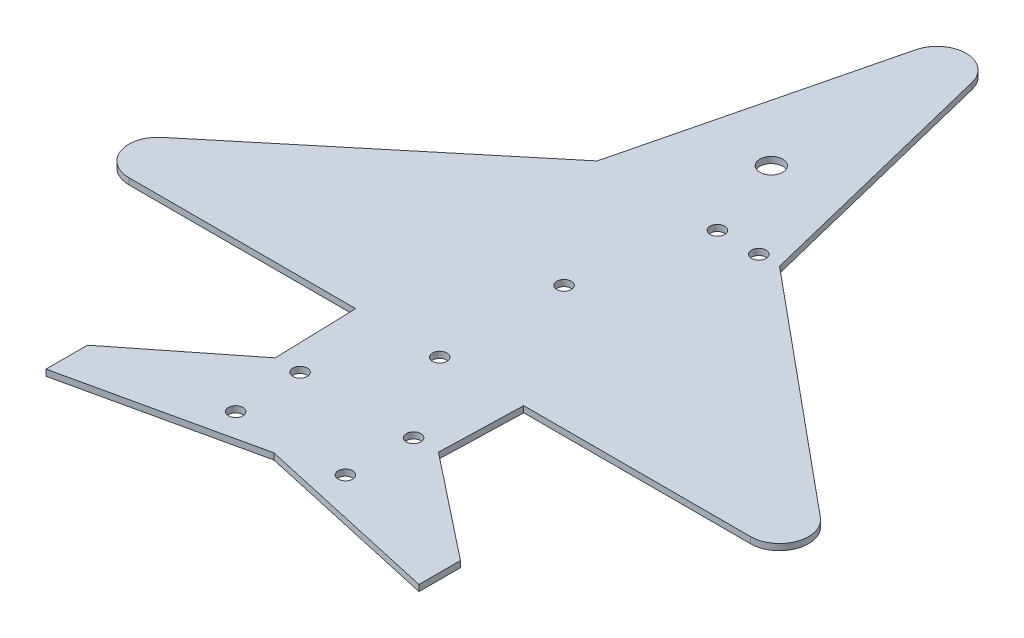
ISO-10303-21;
HEADER;
FILE_DESCRIPTION(('STEP AP214'),'2;1');
FILE_NAME('part.step','',(''),(''),'','','');
FILE_SCHEMA(('AUTOMOTIVE_DESIGN { 1 0 10303 214 1 1 1 1 }'));
ENDSEC;
DATA;
#1=APPLICATION_CONTEXT('core data for automotive mechanical design processes');
#2=APPLICATION_PROTOCOL_DEFINITION('international standard','automotive_design',2000,#1);
#3=PRODUCT_CONTEXT('',#1,'mechanical');
#4=PRODUCT('Part','Part','',(#3));
#5=PRODUCT_RELATED_PRODUCT_CATEGORY('part','',(#4));
#6=PRODUCT_DEFINITION_FORMATION('','',#4);
#7=PRODUCT_DEFINITION_CONTEXT('part definition',#1,'design');
#8=PRODUCT_DEFINITION('design','',#6,#7);
#9=PRODUCT_DEFINITION_SHAPE('','',#8);
#10=(LENGTH_UNIT() NAMED_UNIT(*) SI_UNIT(.MILLI.,.METRE.));
#11=(NAMED_UNIT(*) PLANE_ANGLE_UNIT() SI_UNIT($,.RADIAN.));
#12=(NAMED_UNIT(*) SI_UNIT($,.STERADIAN.) SOLID_ANGLE_UNIT());
#13=UNCERTAINTY_MEASURE_WITH_UNIT(LENGTH_MEASURE(1.E-05),#10,'distance_accuracy_value','');
#14=(GEOMETRIC_REPRESENTATION_CONTEXT(3) GLOBAL_UNCERTAINTY_ASSIGNED_CONTEXT((#13)) GLOBAL_UNIT_ASSIGNED_CONTEXT((#10,
#11,#12)) REPRESENTATION_CONTEXT('',''));
#15=CARTESIAN_POINT('',(0.,0.,0.));
#16=DIRECTION('',(0.,0.,1.));
#17=DIRECTION('',(1.,0.,0.));
#18=AXIS2_PLACEMENT_3D('',#15,#16,#17);
#19=CARTESIAN_POINT('',(-75.,1.5,-47.));
#20=DIRECTION('',(0.,-1.,0.));
#21=DIRECTION('',(0.,0.,-1.));
#22=AXIS2_PLACEMENT_3D('',#19,#20,#21);
#23=PLANE('',#22);
#24=DIRECTION('',(0.976187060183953,0.,-0.216930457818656));
#25=VECTOR('',#24,1.);
#26=CARTESIAN_POINT('',(0.,1.5,0.));
#27=LINE('',#26,#25);
#28=CARTESIAN_POINT('',(-45.,1.5,9.99999999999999));
#29=VERTEX_POINT('',#28);
#30=CARTESIAN_POINT('',(0.,1.5,0.));
#31=VERTEX_POINT('',#30);
#32=EDGE_CURVE('E217',#29,#31,#27,.T.);
#33=ORIENTED_EDGE('',*,*,#32,.T.);
#34=DIRECTION('',(0.976187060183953,0.,0.216930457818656));
#35=VECTOR('',#34,1.);
#36=CARTESIAN_POINT('',(0.,1.5,0.));
#37=LINE('',#36,#35);
#38=CARTESIAN_POINT('',(45.,1.5,10.));
#39=VERTEX_POINT('',#38);
#40=EDGE_CURVE('E120',#31,#39,#37,.T.);
#41=ORIENTED_EDGE('',*,*,#40,.T.);
#42=DIRECTION('',(0.,0.,-1.));
#43=VECTOR('',#42,1.);
#44=CARTESIAN_POINT('',(45.,1.5,10.));
#45=LINE('',#44,#43);
#46=CARTESIAN_POINT('',(45.,1.5,0.));
#47=VERTEX_POINT('',#46);
#48=EDGE_CURVE('E259',#39,#47,#45,.T.);
#49=ORIENTED_EDGE('',*,*,#48,.T.);
#50=DIRECTION('',(-0.784518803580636,0.,-0.620105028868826));
#51=VECTOR('',#50,1.);
#52=CARTESIAN_POINT('',(45.,1.5,0.));
#53=LINE('',#52,#51);
#54=CARTESIAN_POINT('',(19.6972281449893,1.5,-20.));
#55=VERTEX_POINT('',#54);
#56=EDGE_CURVE('E278',#47,#55,#53,.T.);
#57=ORIENTED_EDGE('',*,*,#56,.T.);
#58=DIRECTION('',(0.0287727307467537,0.,-0.999585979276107));
#59=VECTOR('',#58,1.);
#60=CARTESIAN_POINT('',(19.6972281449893,1.5,-20.));
#61=LINE('',#60,#59);
#62=CARTESIAN_POINT('',(20.272921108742,1.5,-40.));
#63=VERTEX_POINT('',#62);
#64=EDGE_CURVE('E275',#55,#63,#61,.T.);
#65=ORIENTED_EDGE('',*,*,#64,.T.);
#66=DIRECTION('',(1.,0.,0.));
#67=VECTOR('',#66,1.);
#68=CARTESIAN_POINT('',(20.272921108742,1.5,-40.));
#69=LINE('',#68,#67);
#70=CARTESIAN_POINT('',(75.,1.5,-40.));
#71=VERTEX_POINT('',#70);
#72=EDGE_CURVE('E277',#63,#71,#69,.T.);
#73=ORIENTED_EDGE('',*,*,#72,.T.);
#74=CARTESIAN_POINT('',(75.,1.5,-47.));
#75=DIRECTION('',(0.,1.,0.));
#76=DIRECTION('',(0.,0.,1.));
#77=AXIS2_PLACEMENT_3D('',#74,#75,#76);
#78=CIRCLE('',#77,7.);
#79=CARTESIAN_POINT('',(79.465850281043,1.5,-52.3903785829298));
#80=VERTEX_POINT('',#79);
#81=EDGE_CURVE('E280',#71,#80,#78,.T.);
#82=ORIENTED_EDGE('',*,*,#81,.T.);
#83=DIRECTION('',(-0.770054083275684,0.,-0.637978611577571));
#84=VECTOR('',#83,1.);
#85=CARTESIAN_POINT('',(22.,1.5,-100.));
#86=LINE('',#85,#84);
#87=CARTESIAN_POINT('',(22.,1.5,-100.));
#88=VERTEX_POINT('',#87);
#89=EDGE_CURVE('E286',#80,#88,#86,.T.);
#90=ORIENTED_EDGE('',*,*,#89,.T.);
#91=DIRECTION('',(-0.239342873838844,0.,-0.970935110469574));
#92=VECTOR('',#91,1.);
#93=CARTESIAN_POINT('',(22.,1.5,-100.));
#94=LINE('',#93,#92);
#95=CARTESIAN_POINT('',(6.79654577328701,1.5,-161.675400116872));
#96=VERTEX_POINT('',#95);
#97=EDGE_CURVE('E288',#88,#96,#94,.T.);
#98=ORIENTED_EDGE('',*,*,#97,.T.);
#99=CARTESIAN_POINT('',(0.,1.5,-160.));
#100=DIRECTION('',(0.,1.,0.));
#101=DIRECTION('',(0.,0.,1.));
#102=AXIS2_PLACEMENT_3D('',#99,#100,#101);
#103=CIRCLE('',#102,6.99999999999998);
#104=CARTESIAN_POINT('',(-6.79654577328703,1.5,-161.675400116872));
#105=VERTEX_POINT('',#104);
#106=EDGE_CURVE('E290',#96,#105,#103,.T.);
#107=ORIENTED_EDGE('',*,*,#106,.T.);
#108=DIRECTION('',(-0.239342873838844,0.,0.970935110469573));
#109=VECTOR('',#108,1.);
#110=CARTESIAN_POINT('',(-22.,1.5,-99.9999999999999));
#111=LINE('',#110,#109);
#112=CARTESIAN_POINT('',(-22.,1.5,-99.9999999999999));
#113=VERTEX_POINT('',#112);
#114=EDGE_CURVE('E292',#105,#113,#111,.T.);
#115=ORIENTED_EDGE('',*,*,#114,.T.);
#116=DIRECTION('',(-0.770054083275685,0.,0.637978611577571));
#117=VECTOR('',#116,1.);
#118=CARTESIAN_POINT('',(-22.,1.5,-99.9999999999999));
#119=LINE('',#118,#117);
#120=CARTESIAN_POINT('',(-79.465850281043,1.5,-52.3903785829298));
#121=VERTEX_POINT('',#120);
#122=EDGE_CURVE('E294',#113,#121,#119,.T.);
#123=ORIENTED_EDGE('',*,*,#122,.T.);
#124=CARTESIAN_POINT('',(-75.,1.5,-47.));
#125=DIRECTION('',(0.,1.,0.));
#126=DIRECTION('',(0.,0.,-1.));
#127=AXIS2_PLACEMENT_3D('',#124,#125,#126);
#128=CIRCLE('',#127,7.);
#129=CARTESIAN_POINT('',(-75.,1.5,-40.));
#130=VERTEX_POINT('',#129);
#131=EDGE_CURVE('E296',#121,#130,#128,.T.);
#132=ORIENTED_EDGE('',*,*,#131,.T.);
#133=DIRECTION('',(1.,0.,0.));
#134=VECTOR('',#133,1.);
#135=CARTESIAN_POINT('',(-20.272921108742,1.5,-40.));
#136=LINE('',#135,#134);
#137=CARTESIAN_POINT('',(-20.272921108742,1.5,-40.));
#138=VERTEX_POINT('',#137);
#139=EDGE_CURVE('E166',#130,#138,#136,.T.);
#140=ORIENTED_EDGE('',*,*,#139,.T.);
#141=DIRECTION('',(0.0287727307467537,0.,0.999585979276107));
#142=VECTOR('',#141,1.);
#143=CARTESIAN_POINT('',(-19.6972281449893,1.5,-20.));
#144=LINE('',#143,#142);
#145=CARTESIAN_POINT('',(-19.6972281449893,1.5,-20.));
#146=VERTEX_POINT('',#145);
#147=EDGE_CURVE('E160',#138,#146,#144,.T.);
#148=ORIENTED_EDGE('',*,*,#147,.T.);
#149=DIRECTION('',(-0.784518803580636,0.,0.620105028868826));
#150=VECTOR('',#149,1.);
#151=CARTESIAN_POINT('',(-45.,1.5,0.));
#152=LINE('',#151,#150);
#153=CARTESIAN_POINT('',(-45.,1.5,0.));
#154=VERTEX_POINT('',#153);
#155=EDGE_CURVE('E164',#146,#154,#152,.T.);
#156=ORIENTED_EDGE('',*,*,#155,.T.);
#157=DIRECTION('',(0.,0.,1.));
#158=VECTOR('',#157,1.);
#159=CARTESIAN_POINT('',(-45.,1.5,9.99999999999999));
#160=LINE('',#159,#158);
#161=EDGE_CURVE('E50',#154,#29,#160,.T.);
#162=ORIENTED_EDGE('',*,*,#161,.T.);
#163=EDGE_LOOP('',(#33,#41,#49,#57,#65,#73,#82,#90,#98,#107,#115,#123,#132,#140,#148,#156,#162));
#164=FACE_BOUND('',#163,.T.);
#165=CARTESIAN_POINT('',(13.694742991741,1.5,-20.));
#166=DIRECTION('',(0.,1.,0.));
#167=DIRECTION('',(0.,0.,1.));
#168=AXIS2_PLACEMENT_3D('',#165,#166,#167);
#169=CIRCLE('',#168,1.75);
#170=CARTESIAN_POINT('',(13.694742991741,1.5,-18.25));
#171=VERTEX_POINT('',#170);
#172=EDGE_CURVE('E188',#171,#171,#169,.T.);
#173=ORIENTED_EDGE('',*,*,#172,.F.);
#174=EDGE_LOOP('',(#173));
#175=FACE_BOUND('',#174,.T.);
#176=CARTESIAN_POINT('',(13.2341886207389,1.5,-4.));
#177=DIRECTION('',(0.,1.,0.));
#178=DIRECTION('',(0.,0.,1.));
#179=AXIS2_PLACEMENT_3D('',#176,#177,#178);
#180=CIRCLE('',#179,1.75);
#181=CARTESIAN_POINT('',(13.2341886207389,1.5,-2.25));
#182=VERTEX_POINT('',#181);
#183=EDGE_CURVE('E410',#182,#182,#180,.T.);
#184=ORIENTED_EDGE('',*,*,#183,.F.);
#185=EDGE_LOOP('',(#184));
#186=FACE_BOUND('',#185,.T.);
#187=CARTESIAN_POINT('',(-13.694742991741,1.5,-20.));
#188=DIRECTION('',(0.,1.,0.));
#189=DIRECTION('',(0.,0.,-1.));
#190=AXIS2_PLACEMENT_3D('',#187,#188,#189);
#191=CIRCLE('',#190,1.75);
#192=CARTESIAN_POINT('',(-13.694742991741,1.5,-21.75));
#193=VERTEX_POINT('',#192);
#194=EDGE_CURVE('E404',#193,#193,#191,.T.);
#195=ORIENTED_EDGE('',*,*,#194,.F.);
#196=EDGE_LOOP('',(#195));
#197=FACE_BOUND('',#196,.T.);
#198=CARTESIAN_POINT('',(-13.2341886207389,1.5,-4.));
#199=DIRECTION('',(0.,1.,0.));
#200=DIRECTION('',(0.,0.,-1.));
#201=AXIS2_PLACEMENT_3D('',#198,#199,#200);
#202=CIRCLE('',#201,1.75);
#203=CARTESIAN_POINT('',(-13.2341886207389,1.5,-5.75));
#204=VERTEX_POINT('',#203);
#205=EDGE_CURVE('E398',#204,#204,#202,.T.);
#206=ORIENTED_EDGE('',*,*,#205,.F.);
#207=EDGE_LOOP('',(#206));
#208=FACE_BOUND('',#207,.T.);
#209=CARTESIAN_POINT('',(0.,1.5,-40.));
#210=DIRECTION('',(0.,1.,0.));
#211=DIRECTION('',(0.,0.,1.));
#212=AXIS2_PLACEMENT_3D('',#209,#210,#211);
#213=CIRCLE('',#212,1.75);
#214=CARTESIAN_POINT('',(0.,1.5,-38.25));
#215=VERTEX_POINT('',#214);
#216=EDGE_CURVE('E392',#215,#215,#213,.T.);
#217=ORIENTED_EDGE('',*,*,#216,.F.);
#218=EDGE_LOOP('',(#217));
#219=FACE_BOUND('',#218,.T.);
#220=CARTESIAN_POINT('',(0.,1.5,-70.));
#221=DIRECTION('',(0.,1.,0.));
#222=DIRECTION('',(0.,0.,1.));
#223=AXIS2_PLACEMENT_3D('',#220,#221,#222);
#224=CIRCLE('',#223,1.75);
#225=CARTESIAN_POINT('',(0.,1.5,-68.25));
#226=VERTEX_POINT('',#225);
#227=EDGE_CURVE('E386',#226,#226,#224,.T.);
#228=ORIENTED_EDGE('',*,*,#227,.F.);
#229=EDGE_LOOP('',(#228));
#230=FACE_BOUND('',#229,.T.);
#231=CARTESIAN_POINT('',(0.,1.5,-120.));
#232=DIRECTION('',(0.,1.,0.));
#233=DIRECTION('',(0.,0.,1.));
#234=AXIS2_PLACEMENT_3D('',#231,#232,#233);
#235=CIRCLE('',#234,2.75);
#236=CARTESIAN_POINT('',(0.,1.5,-117.25));
#237=VERTEX_POINT('',#236);
#238=EDGE_CURVE('E380',#237,#237,#235,.T.);
#239=ORIENTED_EDGE('',*,*,#238,.F.);
#240=EDGE_LOOP('',(#239));
#241=FACE_BOUND('',#240,.T.);
#242=CARTESIAN_POINT('',(7.,1.5,-100.));
#243=DIRECTION('',(0.,1.,0.));
#244=DIRECTION('',(0.,0.,1.));
#245=AXIS2_PLACEMENT_3D('',#242,#243,#244);
#246=CIRCLE('',#245,1.75);
#247=CARTESIAN_POINT('',(7.,1.5,-98.25));
#248=VERTEX_POINT('',#247);
#249=EDGE_CURVE('E374',#248,#248,#246,.T.);
#250=ORIENTED_EDGE('',*,*,#249,.F.);
#251=EDGE_LOOP('',(#250));
#252=FACE_BOUND('',#251,.T.);
#253=CARTESIAN_POINT('',(17.,1.5,-100.));
#254=DIRECTION('',(0.,1.,0.));
#255=DIRECTION('',(0.,0.,1.));
#256=AXIS2_PLACEMENT_3D('',#253,#254,#255);
#257=CIRCLE('',#256,1.75);
#258=CARTESIAN_POINT('',(17.,1.5,-98.25));
#259=VERTEX_POINT('',#258);
#260=EDGE_CURVE('E365',#259,#259,#257,.T.);
#261=ORIENTED_EDGE('',*,*,#260,.F.);
#262=EDGE_LOOP('',(#261));
#263=FACE_BOUND('',#262,.T.);
#264=ADVANCED_FACE('F33',(#164,#175,#186,#197,#208,#219,#230,#241,#252,#263),#23,.F.);
#265=CARTESIAN_POINT('',(-75.,0.,-47.));
#266=DIRECTION('',(0.,-1.,0.));
#267=DIRECTION('',(0.,0.,-1.));
#268=AXIS2_PLACEMENT_3D('',#265,#266,#267);
#269=PLANE('',#268);
#270=CARTESIAN_POINT('',(7.,0.,-100.));
#271=DIRECTION('',(0.,1.,0.));
#272=DIRECTION('',(0.,0.,1.));
#273=AXIS2_PLACEMENT_3D('',#270,#271,#272);
#274=CIRCLE('',#273,1.75);
#275=CARTESIAN_POINT('',(7.,0.,-98.25));
#276=VERTEX_POINT('',#275);
#277=EDGE_CURVE('E371',#276,#276,#274,.T.);
#278=ORIENTED_EDGE('',*,*,#277,.T.);
#279=EDGE_LOOP('',(#278));
#280=FACE_BOUND('',#279,.T.);
#281=CARTESIAN_POINT('',(0.,0.,-70.));
#282=DIRECTION('',(0.,1.,0.));
#283=DIRECTION('',(0.,0.,1.));
#284=AXIS2_PLACEMENT_3D('',#281,#282,#283);
#285=CIRCLE('',#284,1.75);
#286=CARTESIAN_POINT('',(0.,0.,-68.25));
#287=VERTEX_POINT('',#286);
#288=EDGE_CURVE('E383',#287,#287,#285,.T.);
#289=ORIENTED_EDGE('',*,*,#288,.T.);
#290=EDGE_LOOP('',(#289));
#291=FACE_BOUND('',#290,.T.);
#292=CARTESIAN_POINT('',(-13.2341886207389,0.,-4.));
#293=DIRECTION('',(0.,1.,0.));
#294=DIRECTION('',(0.,0.,-1.));
#295=AXIS2_PLACEMENT_3D('',#292,#293,#294);
#296=CIRCLE('',#295,1.75);
#297=CARTESIAN_POINT('',(-13.2341886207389,0.,-5.75));
#298=VERTEX_POINT('',#297);
#299=EDGE_CURVE('E395',#298,#298,#296,.T.);
#300=ORIENTED_EDGE('',*,*,#299,.T.);
#301=EDGE_LOOP('',(#300));
#302=FACE_BOUND('',#301,.T.);
#303=CARTESIAN_POINT('',(13.2341886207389,0.,-4.));
#304=DIRECTION('',(0.,1.,0.));
#305=DIRECTION('',(0.,0.,1.));
#306=AXIS2_PLACEMENT_3D('',#303,#304,#305);
#307=CIRCLE('',#306,1.75);
#308=CARTESIAN_POINT('',(13.2341886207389,0.,-2.25));
#309=VERTEX_POINT('',#308);
#310=EDGE_CURVE('E407',#309,#309,#307,.T.);
#311=ORIENTED_EDGE('',*,*,#310,.T.);
#312=EDGE_LOOP('',(#311));
#313=FACE_BOUND('',#312,.T.);
#314=DIRECTION('',(0.976187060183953,0.,-0.216930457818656));
#315=VECTOR('',#314,1.);
#316=CARTESIAN_POINT('',(0.,0.,0.));
#317=LINE('',#316,#315);
#318=CARTESIAN_POINT('',(-45.,0.,9.99999999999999));
#319=VERTEX_POINT('',#318);
#320=CARTESIAN_POINT('',(0.,0.,0.));
#321=VERTEX_POINT('',#320);
#322=EDGE_CURVE('E184',#319,#321,#317,.T.);
#323=ORIENTED_EDGE('',*,*,#322,.F.);
#324=DIRECTION('',(0.,0.,1.));
#325=VECTOR('',#324,1.);
#326=CARTESIAN_POINT('',(-45.,0.,9.99999999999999));
#327=LINE('',#326,#325);
#328=CARTESIAN_POINT('',(-45.,0.,0.));
#329=VERTEX_POINT('',#328);
#330=EDGE_CURVE('E112',#329,#319,#327,.T.);
#331=ORIENTED_EDGE('',*,*,#330,.F.);
#332=DIRECTION('',(-0.784518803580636,0.,0.620105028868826));
#333=VECTOR('',#332,1.);
#334=CARTESIAN_POINT('',(-45.,0.,0.));
#335=LINE('',#334,#333);
#336=CARTESIAN_POINT('',(-19.6972281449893,0.,-20.));
#337=VERTEX_POINT('',#336);
#338=EDGE_CURVE('E106',#337,#329,#335,.T.);
#339=ORIENTED_EDGE('',*,*,#338,.F.);
#340=DIRECTION('',(0.0287727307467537,0.,0.999585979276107));
#341=VECTOR('',#340,1.);
#342=CARTESIAN_POINT('',(-19.6972281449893,0.,-20.));
#343=LINE('',#342,#341);
#344=CARTESIAN_POINT('',(-20.272921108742,0.,-40.));
#345=VERTEX_POINT('',#344);
#346=EDGE_CURVE('E174',#345,#337,#343,.T.);
#347=ORIENTED_EDGE('',*,*,#346,.F.);
#348=DIRECTION('',(1.,0.,0.));
#349=VECTOR('',#348,1.);
#350=CARTESIAN_POINT('',(-20.272921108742,0.,-40.));
#351=LINE('',#350,#349);
#352=CARTESIAN_POINT('',(-75.,0.,-40.));
#353=VERTEX_POINT('',#352);
#354=EDGE_CURVE('E212',#353,#345,#351,.T.);
#355=ORIENTED_EDGE('',*,*,#354,.F.);
#356=CARTESIAN_POINT('',(-75.,0.,-47.));
#357=DIRECTION('',(0.,1.,0.));
#358=DIRECTION('',(0.,0.,-1.));
#359=AXIS2_PLACEMENT_3D('',#356,#357,#358);
#360=CIRCLE('',#359,7.);
#361=CARTESIAN_POINT('',(-79.465850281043,0.,-52.3903785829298));
#362=VERTEX_POINT('',#361);
#363=EDGE_CURVE('E210',#362,#353,#360,.T.);
#364=ORIENTED_EDGE('',*,*,#363,.F.);
#365=DIRECTION('',(-0.770054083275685,0.,0.637978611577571));
#366=VECTOR('',#365,1.);
#367=CARTESIAN_POINT('',(-22.,0.,-99.9999999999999));
#368=LINE('',#367,#366);
#369=CARTESIAN_POINT('',(-22.,0.,-99.9999999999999));
#370=VERTEX_POINT('',#369);
#371=EDGE_CURVE('E208',#370,#362,#368,.T.);
#372=ORIENTED_EDGE('',*,*,#371,.F.);
#373=DIRECTION('',(-0.239342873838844,0.,0.970935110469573));
#374=VECTOR('',#373,1.);
#375=CARTESIAN_POINT('',(-22.,0.,-99.9999999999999));
#376=LINE('',#375,#374);
#377=CARTESIAN_POINT('',(-6.79654577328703,0.,-161.675400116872));
#378=VERTEX_POINT('',#377);
#379=EDGE_CURVE('E206',#378,#370,#376,.T.);
#380=ORIENTED_EDGE('',*,*,#379,.F.);
#381=CARTESIAN_POINT('',(0.,0.,-160.));
#382=DIRECTION('',(0.,1.,0.));
#383=DIRECTION('',(0.,0.,1.));
#384=AXIS2_PLACEMENT_3D('',#381,#382,#383);
#385=CIRCLE('',#384,6.99999999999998);
#386=CARTESIAN_POINT('',(6.79654577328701,0.,-161.675400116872));
#387=VERTEX_POINT('',#386);
#388=EDGE_CURVE('E204',#387,#378,#385,.T.);
#389=ORIENTED_EDGE('',*,*,#388,.F.);
#390=DIRECTION('',(-0.239342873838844,0.,-0.970935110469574));
#391=VECTOR('',#390,1.);
#392=CARTESIAN_POINT('',(22.,0.,-100.));
#393=LINE('',#392,#391);
#394=CARTESIAN_POINT('',(22.,0.,-100.));
#395=VERTEX_POINT('',#394);
#396=EDGE_CURVE('E202',#395,#387,#393,.T.);
#397=ORIENTED_EDGE('',*,*,#396,.F.);
#398=DIRECTION('',(-0.770054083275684,0.,-0.637978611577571));
#399=VECTOR('',#398,1.);
#400=CARTESIAN_POINT('',(22.,0.,-100.));
#401=LINE('',#400,#399);
#402=CARTESIAN_POINT('',(79.465850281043,0.,-52.3903785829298));
#403=VERTEX_POINT('',#402);
#404=EDGE_CURVE('E200',#403,#395,#401,.T.);
#405=ORIENTED_EDGE('',*,*,#404,.F.);
#406=CARTESIAN_POINT('',(75.,0.,-47.));
#407=DIRECTION('',(0.,1.,0.));
#408=DIRECTION('',(0.,0.,1.));
#409=AXIS2_PLACEMENT_3D('',#406,#407,#408);
#410=CIRCLE('',#409,7.);
#411=CARTESIAN_POINT('',(75.,0.,-40.));
#412=VERTEX_POINT('',#411);
#413=EDGE_CURVE('E198',#412,#403,#410,.T.);
#414=ORIENTED_EDGE('',*,*,#413,.F.);
#415=DIRECTION('',(1.,0.,0.));
#416=VECTOR('',#415,1.);
#417=CARTESIAN_POINT('',(20.272921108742,0.,-40.));
#418=LINE('',#417,#416);
#419=CARTESIAN_POINT('',(20.272921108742,0.,-40.));
#420=VERTEX_POINT('',#419);
#421=EDGE_CURVE('E196',#420,#412,#418,.T.);
#422=ORIENTED_EDGE('',*,*,#421,.F.);
#423=DIRECTION('',(0.0287727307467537,0.,-0.999585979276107));
#424=VECTOR('',#423,1.);
#425=CARTESIAN_POINT('',(19.6972281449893,0.,-20.));
#426=LINE('',#425,#424);
#427=CARTESIAN_POINT('',(19.6972281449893,0.,-20.));
#428=VERTEX_POINT('',#427);
#429=EDGE_CURVE('E194',#428,#420,#426,.T.);
#430=ORIENTED_EDGE('',*,*,#429,.F.);
#431=DIRECTION('',(-0.784518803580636,0.,-0.620105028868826));
#432=VECTOR('',#431,1.);
#433=CARTESIAN_POINT('',(45.,0.,0.));
#434=LINE('',#433,#432);
#435=CARTESIAN_POINT('',(45.,0.,0.));
#436=VERTEX_POINT('',#435);
#437=EDGE_CURVE('E192',#436,#428,#434,.T.);
#438=ORIENTED_EDGE('',*,*,#437,.F.);
#439=DIRECTION('',(0.,0.,-1.));
#440=VECTOR('',#439,1.);
#441=CARTESIAN_POINT('',(45.,0.,10.));
#442=LINE('',#441,#440);
#443=CARTESIAN_POINT('',(45.,0.,10.));
#444=VERTEX_POINT('',#443);
#445=EDGE_CURVE('E190',#444,#436,#442,.T.);
#446=ORIENTED_EDGE('',*,*,#445,.F.);
#447=DIRECTION('',(0.976187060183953,0.,0.216930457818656));
#448=VECTOR('',#447,1.);
#449=CARTESIAN_POINT('',(0.,0.,0.));
#450=LINE('',#449,#448);
#451=EDGE_CURVE('E187',#321,#444,#450,.T.);
#452=ORIENTED_EDGE('',*,*,#451,.F.);
#453=EDGE_LOOP('',(#323,#331,#339,#347,#355,#364,#372,#380,#389,#397,#405,#414,#422,#430,#438,
#446,#452));
#454=FACE_BOUND('',#453,.T.);
#455=CARTESIAN_POINT('',(13.694742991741,0.,-20.));
#456=DIRECTION('',(0.,1.,0.));
#457=DIRECTION('',(0.,0.,1.));
#458=AXIS2_PLACEMENT_3D('',#455,#456,#457);
#459=CIRCLE('',#458,1.75);
#460=CARTESIAN_POINT('',(13.694742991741,0.,-18.25));
#461=VERTEX_POINT('',#460);
#462=EDGE_CURVE('E413',#461,#461,#459,.T.);
#463=ORIENTED_EDGE('',*,*,#462,.T.);
#464=EDGE_LOOP('',(#463));
#465=FACE_BOUND('',#464,.T.);
#466=CARTESIAN_POINT('',(-13.694742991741,0.,-20.));
#467=DIRECTION('',(0.,1.,0.));
#468=DIRECTION('',(0.,0.,-1.));
#469=AXIS2_PLACEMENT_3D('',#466,#467,#468);
#470=CIRCLE('',#469,1.75);
#471=CARTESIAN_POINT('',(-13.694742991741,0.,-21.75));
#472=VERTEX_POINT('',#471);
#473=EDGE_CURVE('E401',#472,#472,#470,.T.);
#474=ORIENTED_EDGE('',*,*,#473,.T.);
#475=EDGE_LOOP('',(#474));
#476=FACE_BOUND('',#475,.T.);
#477=CARTESIAN_POINT('',(0.,0.,-40.));
#478=DIRECTION('',(0.,1.,0.));
#479=DIRECTION('',(0.,0.,1.));
#480=AXIS2_PLACEMENT_3D('',#477,#478,#479);
#481=CIRCLE('',#480,1.75);
#482=CARTESIAN_POINT('',(0.,0.,-38.25));
#483=VERTEX_POINT('',#482);
#484=EDGE_CURVE('E389',#483,#483,#481,.T.);
#485=ORIENTED_EDGE('',*,*,#484,.T.);
#486=EDGE_LOOP('',(#485));
#487=FACE_BOUND('',#486,.T.);
#488=CARTESIAN_POINT('',(0.,0.,-120.));
#489=DIRECTION('',(0.,1.,0.));
#490=DIRECTION('',(0.,0.,1.));
#491=AXIS2_PLACEMENT_3D('',#488,#489,#490);
#492=CIRCLE('',#491,2.75);
#493=CARTESIAN_POINT('',(0.,0.,-117.25));
#494=VERTEX_POINT('',#493);
#495=EDGE_CURVE('E377',#494,#494,#492,.T.);
#496=ORIENTED_EDGE('',*,*,#495,.T.);
#497=EDGE_LOOP('',(#496));
#498=FACE_BOUND('',#497,.T.);
#499=CARTESIAN_POINT('',(17.,0.,-100.));
#500=DIRECTION('',(0.,1.,0.));
#501=DIRECTION('',(0.,0.,1.));
#502=AXIS2_PLACEMENT_3D('',#499,#500,#501);
#503=CIRCLE('',#502,1.75);
#504=CARTESIAN_POINT('',(17.,0.,-98.25));
#505=VERTEX_POINT('',#504);
#506=EDGE_CURVE('E368',#505,#505,#503,.T.);
#507=ORIENTED_EDGE('',*,*,#506,.T.);
#508=EDGE_LOOP('',(#507));
#509=FACE_BOUND('',#508,.T.);
#510=ADVANCED_FACE('F263',(#280,#291,#302,#313,#454,#465,#476,#487,#498,#509),#269,.T.);
#511=CARTESIAN_POINT('',(0.,1.5,0.));
#512=DIRECTION('',(-0.216930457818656,0.,-0.976187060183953));
#513=DIRECTION('',(-0.976187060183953,0.,0.216930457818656));
#514=AXIS2_PLACEMENT_3D('',#511,#512,#513);
#515=PLANE('',#514);
#516=ORIENTED_EDGE('',*,*,#322,.T.);
#517=DIRECTION('',(0.,-1.,0.));
#518=VECTOR('',#517,1.);
#519=CARTESIAN_POINT('',(0.,1.5,0.));
#520=LINE('',#519,#518);
#521=EDGE_CURVE('E11',#31,#321,#520,.T.);
#522=ORIENTED_EDGE('',*,*,#521,.F.);
#523=ORIENTED_EDGE('',*,*,#32,.F.);
#524=DIRECTION('',(0.,-1.,0.));
#525=VECTOR('',#524,1.);
#526=CARTESIAN_POINT('',(-45.,1.5,9.99999999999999));
#527=LINE('',#526,#525);
#528=EDGE_CURVE('E180',#29,#319,#527,.T.);
#529=ORIENTED_EDGE('',*,*,#528,.T.);
#530=EDGE_LOOP('',(#516,#522,#523,#529));
#531=FACE_BOUND('',#530,.T.);
#532=ADVANCED_FACE('F35',(#531),#515,.F.);
#533=CARTESIAN_POINT('',(0.,1.5,0.));
#534=DIRECTION('',(0.216930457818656,0.,-0.976187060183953));
#535=DIRECTION('',(-0.976187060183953,0.,-0.216930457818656));
#536=AXIS2_PLACEMENT_3D('',#533,#534,#535);
#537=PLANE('',#536);
#538=ORIENTED_EDGE('',*,*,#451,.T.);
#539=DIRECTION('',(0.,-1.,0.));
#540=VECTOR('',#539,1.);
#541=CARTESIAN_POINT('',(45.,1.5,10.));
#542=LINE('',#541,#540);
#543=EDGE_CURVE('E42',#39,#444,#542,.T.);
#544=ORIENTED_EDGE('',*,*,#543,.F.);
#545=ORIENTED_EDGE('',*,*,#40,.F.);
#546=ORIENTED_EDGE('',*,*,#521,.T.);
#547=EDGE_LOOP('',(#538,#544,#545,#546));
#548=FACE_BOUND('',#547,.T.);
#549=ADVANCED_FACE('F620',(#548),#537,.F.);
#550=CARTESIAN_POINT('',(45.,1.5,10.));
#551=DIRECTION('',(-1.,0.,0.));
#552=DIRECTION('',(0.,0.,1.));
#553=AXIS2_PLACEMENT_3D('',#550,#551,#552);
#554=PLANE('',#553);
#555=ORIENTED_EDGE('',*,*,#445,.T.);
#556=DIRECTION('',(0.,-1.,0.));
#557=VECTOR('',#556,1.);
#558=CARTESIAN_POINT('',(45.,1.5,0.));
#559=LINE('',#558,#557);
#560=EDGE_CURVE('E251',#47,#436,#559,.T.);
#561=ORIENTED_EDGE('',*,*,#560,.F.);
#562=ORIENTED_EDGE('',*,*,#48,.F.);
#563=ORIENTED_EDGE('',*,*,#543,.T.);
#564=EDGE_LOOP('',(#555,#561,#562,#563));
#565=FACE_BOUND('',#564,.T.);
#566=ADVANCED_FACE('F257',(#565),#554,.F.);
#567=CARTESIAN_POINT('',(45.,1.5,0.));
#568=DIRECTION('',(-0.620105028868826,0.,0.784518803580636));
#569=DIRECTION('',(0.784518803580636,0.,0.620105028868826));
#570=AXIS2_PLACEMENT_3D('',#567,#568,#569);
#571=PLANE('',#570);
#572=ORIENTED_EDGE('',*,*,#437,.T.);
#573=DIRECTION('',(0.,-1.,0.));
#574=VECTOR('',#573,1.);
#575=CARTESIAN_POINT('',(19.6972281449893,1.5,-20.));
#576=LINE('',#575,#574);
#577=EDGE_CURVE('E248',#55,#428,#576,.T.);
#578=ORIENTED_EDGE('',*,*,#577,.F.);
#579=ORIENTED_EDGE('',*,*,#56,.F.);
#580=ORIENTED_EDGE('',*,*,#560,.T.);
#581=EDGE_LOOP('',(#572,#578,#579,#580));
#582=FACE_BOUND('',#581,.T.);
#583=ADVANCED_FACE('F269',(#582),#571,.F.);
#584=CARTESIAN_POINT('',(19.6972281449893,1.5,-20.));
#585=DIRECTION('',(-0.999585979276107,0.,-0.0287727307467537));
#586=DIRECTION('',(-0.0287727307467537,0.,0.999585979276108));
#587=AXIS2_PLACEMENT_3D('',#584,#585,#586);
#588=PLANE('',#587);
#589=ORIENTED_EDGE('',*,*,#429,.T.);
#590=DIRECTION('',(0.,-1.,0.));
#591=VECTOR('',#590,1.);
#592=CARTESIAN_POINT('',(20.272921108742,1.5,-40.));
#593=LINE('',#592,#591);
#594=EDGE_CURVE('E245',#63,#420,#593,.T.);
#595=ORIENTED_EDGE('',*,*,#594,.F.);
#596=ORIENTED_EDGE('',*,*,#64,.F.);
#597=ORIENTED_EDGE('',*,*,#577,.T.);
#598=EDGE_LOOP('',(#589,#595,#596,#597));
#599=FACE_BOUND('',#598,.T.);
#600=ADVANCED_FACE('F273',(#599),#588,.F.);
#601=CARTESIAN_POINT('',(20.272921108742,1.5,-40.));
#602=DIRECTION('',(0.,0.,-1.));
#603=DIRECTION('',(-1.,0.,0.));
#604=AXIS2_PLACEMENT_3D('',#601,#602,#603);
#605=PLANE('',#604);
#606=ORIENTED_EDGE('',*,*,#421,.T.);
#607=DIRECTION('',(0.,-1.,0.));
#608=VECTOR('',#607,1.);
#609=CARTESIAN_POINT('',(75.,1.5,-40.));
#610=LINE('',#609,#608);
#611=EDGE_CURVE('E242',#71,#412,#610,.T.);
#612=ORIENTED_EDGE('',*,*,#611,.F.);
#613=ORIENTED_EDGE('',*,*,#72,.F.);
#614=ORIENTED_EDGE('',*,*,#594,.T.);
#615=EDGE_LOOP('',(#606,#612,#613,#614));
#616=FACE_BOUND('',#615,.T.);
#617=ADVANCED_FACE('F585',(#616),#605,.F.);
#618=CARTESIAN_POINT('',(75.,1.5,-47.));
#619=DIRECTION('',(0.,-1.,0.));
#620=DIRECTION('',(0.,0.,-1.));
#621=AXIS2_PLACEMENT_3D('',#618,#619,#620);
#622=CYLINDRICAL_SURFACE('',#621,7.);
#623=ORIENTED_EDGE('',*,*,#413,.T.);
#624=DIRECTION('',(0.,-1.,0.));
#625=VECTOR('',#624,1.);
#626=CARTESIAN_POINT('',(79.465850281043,1.5,-52.3903785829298));
#627=LINE('',#626,#625);
#628=EDGE_CURVE('E239',#80,#403,#627,.T.);
#629=ORIENTED_EDGE('',*,*,#628,.F.);
#630=ORIENTED_EDGE('',*,*,#81,.F.);
#631=ORIENTED_EDGE('',*,*,#611,.T.);
#632=EDGE_LOOP('',(#623,#629,#630,#631));
#633=FACE_BOUND('',#632,.T.);
#634=ADVANCED_FACE('F575',(#633),#622,.T.);
#635=CARTESIAN_POINT('',(22.,1.5,-100.));
#636=DIRECTION('',(-0.637978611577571,0.,0.770054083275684));
#637=DIRECTION('',(0.770054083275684,0.,0.637978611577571));
#638=AXIS2_PLACEMENT_3D('',#635,#636,#637);
#639=PLANE('',#638);
#640=ORIENTED_EDGE('',*,*,#404,.T.);
#641=DIRECTION('',(0.,-1.,0.));
#642=VECTOR('',#641,1.);
#643=CARTESIAN_POINT('',(22.,1.5,-100.));
#644=LINE('',#643,#642);
#645=EDGE_CURVE('E236',#88,#395,#644,.T.);
#646=ORIENTED_EDGE('',*,*,#645,.F.);
#647=ORIENTED_EDGE('',*,*,#89,.F.);
#648=ORIENTED_EDGE('',*,*,#628,.T.);
#649=EDGE_LOOP('',(#640,#646,#647,#648));
#650=FACE_BOUND('',#649,.T.);
#651=ADVANCED_FACE('F565',(#650),#639,.F.);
#652=CARTESIAN_POINT('',(22.,1.5,-100.));
#653=DIRECTION('',(-0.970935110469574,0.,0.239342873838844));
#654=DIRECTION('',(0.239342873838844,0.,0.970935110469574));
#655=AXIS2_PLACEMENT_3D('',#652,#653,#654);
#656=PLANE('',#655);
#657=ORIENTED_EDGE('',*,*,#396,.T.);
#658=DIRECTION('',(0.,-1.,0.));
#659=VECTOR('',#658,1.);
#660=CARTESIAN_POINT('',(6.79654577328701,1.5,-161.675400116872));
#661=LINE('',#660,#659);
#662=EDGE_CURVE('E233',#96,#387,#661,.T.);
#663=ORIENTED_EDGE('',*,*,#662,.F.);
#664=ORIENTED_EDGE('',*,*,#97,.F.);
#665=ORIENTED_EDGE('',*,*,#645,.T.);
#666=EDGE_LOOP('',(#657,#663,#664,#665));
#667=FACE_BOUND('',#666,.T.);
#668=ADVANCED_FACE('F555',(#667),#656,.F.);
#669=CARTESIAN_POINT('',(0.,1.5,-160.));
#670=DIRECTION('',(0.,-1.,0.));
#671=DIRECTION('',(0.,0.,-1.));
#672=AXIS2_PLACEMENT_3D('',#669,#670,#671);
#673=CYLINDRICAL_SURFACE('',#672,6.99999999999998);
#674=ORIENTED_EDGE('',*,*,#388,.T.);
#675=DIRECTION('',(0.,-1.,0.));
#676=VECTOR('',#675,1.);
#677=CARTESIAN_POINT('',(-6.79654577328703,1.5,-161.675400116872));
#678=LINE('',#677,#676);
#679=EDGE_CURVE('E230',#105,#378,#678,.T.);
#680=ORIENTED_EDGE('',*,*,#679,.F.);
#681=ORIENTED_EDGE('',*,*,#106,.F.);
#682=ORIENTED_EDGE('',*,*,#662,.T.);
#683=EDGE_LOOP('',(#674,#680,#681,#682));
#684=FACE_BOUND('',#683,.T.);
#685=ADVANCED_FACE('F545',(#684),#673,.T.);
#686=CARTESIAN_POINT('',(-22.,1.5,-99.9999999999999));
#687=DIRECTION('',(0.970935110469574,0.,0.239342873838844));
#688=DIRECTION('',(0.239342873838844,0.,-0.970935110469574));
#689=AXIS2_PLACEMENT_3D('',#686,#687,#688);
#690=PLANE('',#689);
#691=ORIENTED_EDGE('',*,*,#379,.T.);
#692=DIRECTION('',(0.,-1.,0.));
#693=VECTOR('',#692,1.);
#694=CARTESIAN_POINT('',(-22.,1.5,-99.9999999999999));
#695=LINE('',#694,#693);
#696=EDGE_CURVE('E227',#113,#370,#695,.T.);
#697=ORIENTED_EDGE('',*,*,#696,.F.);
#698=ORIENTED_EDGE('',*,*,#114,.F.);
#699=ORIENTED_EDGE('',*,*,#679,.T.);
#700=EDGE_LOOP('',(#691,#697,#698,#699));
#701=FACE_BOUND('',#700,.T.);
#702=ADVANCED_FACE('F535',(#701),#690,.F.);
#703=CARTESIAN_POINT('',(-22.,1.5,-99.9999999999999));
#704=DIRECTION('',(0.637978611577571,0.,0.770054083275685));
#705=DIRECTION('',(0.770054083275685,0.,-0.637978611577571));
#706=AXIS2_PLACEMENT_3D('',#703,#704,#705);
#707=PLANE('',#706);
#708=ORIENTED_EDGE('',*,*,#371,.T.);
#709=DIRECTION('',(0.,-1.,0.));
#710=VECTOR('',#709,1.);
#711=CARTESIAN_POINT('',(-79.465850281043,1.5,-52.3903785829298));
#712=LINE('',#711,#710);
#713=EDGE_CURVE('E224',#121,#362,#712,.T.);
#714=ORIENTED_EDGE('',*,*,#713,.F.);
#715=ORIENTED_EDGE('',*,*,#122,.F.);
#716=ORIENTED_EDGE('',*,*,#696,.T.);
#717=EDGE_LOOP('',(#708,#714,#715,#716));
#718=FACE_BOUND('',#717,.T.);
#719=ADVANCED_FACE('F526',(#718),#707,.F.);
#720=CARTESIAN_POINT('',(-75.,1.5,-47.));
#721=DIRECTION('',(0.,-1.,0.));
#722=DIRECTION('',(0.,0.,-1.));
#723=AXIS2_PLACEMENT_3D('',#720,#721,#722);
#724=CYLINDRICAL_SURFACE('',#723,7.);
#725=ORIENTED_EDGE('',*,*,#363,.T.);
#726=DIRECTION('',(0.,-1.,0.));
#727=VECTOR('',#726,1.);
#728=CARTESIAN_POINT('',(-75.,1.5,-40.));
#729=LINE('',#728,#727);
#730=EDGE_CURVE('E221',#130,#353,#729,.T.);
#731=ORIENTED_EDGE('',*,*,#730,.F.);
#732=ORIENTED_EDGE('',*,*,#131,.F.);
#733=ORIENTED_EDGE('',*,*,#713,.T.);
#734=EDGE_LOOP('',(#725,#731,#732,#733));
#735=FACE_BOUND('',#734,.T.);
#736=ADVANCED_FACE('F302',(#735),#724,.T.);
#737=CARTESIAN_POINT('',(-20.272921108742,1.5,-40.));
#738=DIRECTION('',(0.,0.,-1.));
#739=DIRECTION('',(-1.,0.,0.));
#740=AXIS2_PLACEMENT_3D('',#737,#738,#739);
#741=PLANE('',#740);
#742=ORIENTED_EDGE('',*,*,#354,.T.);
#743=DIRECTION('',(0.,-1.,0.));
#744=VECTOR('',#743,1.);
#745=CARTESIAN_POINT('',(-20.272921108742,1.5,-40.));
#746=LINE('',#745,#744);
#747=EDGE_CURVE('E175',#138,#345,#746,.T.);
#748=ORIENTED_EDGE('',*,*,#747,.F.);
#749=ORIENTED_EDGE('',*,*,#139,.F.);
#750=ORIENTED_EDGE('',*,*,#730,.T.);
#751=EDGE_LOOP('',(#742,#748,#749,#750));
#752=FACE_BOUND('',#751,.T.);
#753=ADVANCED_FACE('F306',(#752),#741,.F.);
#754=CARTESIAN_POINT('',(-19.6972281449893,1.5,-20.));
#755=DIRECTION('',(0.999585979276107,0.,-0.0287727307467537));
#756=DIRECTION('',(-0.0287727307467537,0.,-0.999585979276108));
#757=AXIS2_PLACEMENT_3D('',#754,#755,#756);
#758=PLANE('',#757);
#759=ORIENTED_EDGE('',*,*,#346,.T.);
#760=DIRECTION('',(0.,-1.,0.));
#761=VECTOR('',#760,1.);
#762=CARTESIAN_POINT('',(-19.6972281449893,1.5,-20.));
#763=LINE('',#762,#761);
#764=EDGE_CURVE('E171',#146,#337,#763,.T.);
#765=ORIENTED_EDGE('',*,*,#764,.F.);
#766=ORIENTED_EDGE('',*,*,#147,.F.);
#767=ORIENTED_EDGE('',*,*,#747,.T.);
#768=EDGE_LOOP('',(#759,#765,#766,#767));
#769=FACE_BOUND('',#768,.T.);
#770=ADVANCED_FACE('F172',(#769),#758,.F.);
#771=CARTESIAN_POINT('',(-45.,1.5,0.));
#772=DIRECTION('',(0.620105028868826,0.,0.784518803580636));
#773=DIRECTION('',(0.784518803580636,0.,-0.620105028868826));
#774=AXIS2_PLACEMENT_3D('',#771,#772,#773);
#775=PLANE('',#774);
#776=ORIENTED_EDGE('',*,*,#338,.T.);
#777=DIRECTION('',(0.,-1.,0.));
#778=VECTOR('',#777,1.);
#779=CARTESIAN_POINT('',(-45.,1.5,0.));
#780=LINE('',#779,#778);
#781=EDGE_CURVE('E176',#154,#329,#780,.T.);
#782=ORIENTED_EDGE('',*,*,#781,.F.);
#783=ORIENTED_EDGE('',*,*,#155,.F.);
#784=ORIENTED_EDGE('',*,*,#764,.T.);
#785=EDGE_LOOP('',(#776,#782,#783,#784));
#786=FACE_BOUND('',#785,.T.);
#787=ADVANCED_FACE('F178',(#786),#775,.F.);
#788=CARTESIAN_POINT('',(-45.,1.5,9.99999999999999));
#789=DIRECTION('',(1.,0.,0.));
#790=DIRECTION('',(0.,0.,-1.));
#791=AXIS2_PLACEMENT_3D('',#788,#789,#790);
#792=PLANE('',#791);
#793=ORIENTED_EDGE('',*,*,#330,.T.);
#794=ORIENTED_EDGE('',*,*,#528,.F.);
#795=ORIENTED_EDGE('',*,*,#161,.F.);
#796=ORIENTED_EDGE('',*,*,#781,.T.);
#797=EDGE_LOOP('',(#793,#794,#795,#796));
#798=FACE_BOUND('',#797,.T.);
#799=ADVANCED_FACE('F310',(#798),#792,.F.);
#800=CARTESIAN_POINT('',(13.694742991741,1.5,-20.));
#801=DIRECTION('',(0.,-1.,0.));
#802=DIRECTION('',(0.,0.,-1.));
#803=AXIS2_PLACEMENT_3D('',#800,#801,#802);
#804=CYLINDRICAL_SURFACE('',#803,1.75);
#805=ORIENTED_EDGE('',*,*,#172,.T.);
#806=EDGE_LOOP('',(#805));
#807=FACE_BOUND('',#806,.T.);
#808=ORIENTED_EDGE('',*,*,#462,.F.);
#809=EDGE_LOOP('',(#808));
#810=FACE_BOUND('',#809,.T.);
#811=ADVANCED_FACE('F312',(#807,#810),#804,.F.);
#812=CARTESIAN_POINT('',(13.2341886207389,1.5,-4.));
#813=DIRECTION('',(0.,-1.,0.));
#814=DIRECTION('',(0.,0.,-1.));
#815=AXIS2_PLACEMENT_3D('',#812,#813,#814);
#816=CYLINDRICAL_SURFACE('',#815,1.75);
#817=ORIENTED_EDGE('',*,*,#183,.T.);
#818=EDGE_LOOP('',(#817));
#819=FACE_BOUND('',#818,.T.);
#820=ORIENTED_EDGE('',*,*,#310,.F.);
#821=EDGE_LOOP('',(#820));
#822=FACE_BOUND('',#821,.T.);
#823=ADVANCED_FACE('F318',(#819,#822),#816,.F.);
#824=CARTESIAN_POINT('',(-13.694742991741,1.5,-20.));
#825=DIRECTION('',(0.,-1.,0.));
#826=DIRECTION('',(0.,0.,-1.));
#827=AXIS2_PLACEMENT_3D('',#824,#825,#826);
#828=CYLINDRICAL_SURFACE('',#827,1.75);
#829=ORIENTED_EDGE('',*,*,#194,.T.);
#830=EDGE_LOOP('',(#829));
#831=FACE_BOUND('',#830,.T.);
#832=ORIENTED_EDGE('',*,*,#473,.F.);
#833=EDGE_LOOP('',(#832));
#834=FACE_BOUND('',#833,.T.);
#835=ADVANCED_FACE('F332',(#831,#834),#828,.F.);
#836=CARTESIAN_POINT('',(-13.2341886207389,1.5,-4.));
#837=DIRECTION('',(0.,-1.,0.));
#838=DIRECTION('',(0.,0.,-1.));
#839=AXIS2_PLACEMENT_3D('',#836,#837,#838);
#840=CYLINDRICAL_SURFACE('',#839,1.75);
#841=ORIENTED_EDGE('',*,*,#205,.T.);
#842=EDGE_LOOP('',(#841));
#843=FACE_BOUND('',#842,.T.);
#844=ORIENTED_EDGE('',*,*,#299,.F.);
#845=EDGE_LOOP('',(#844));
#846=FACE_BOUND('',#845,.T.);
#847=ADVANCED_FACE('F336',(#843,#846),#840,.F.);
#848=CARTESIAN_POINT('',(0.,1.5,-40.));
#849=DIRECTION('',(0.,-1.,0.));
#850=DIRECTION('',(0.,0.,-1.));
#851=AXIS2_PLACEMENT_3D('',#848,#849,#850);
#852=CYLINDRICAL_SURFACE('',#851,1.75);
#853=ORIENTED_EDGE('',*,*,#216,.T.);
#854=EDGE_LOOP('',(#853));
#855=FACE_BOUND('',#854,.T.);
#856=ORIENTED_EDGE('',*,*,#484,.F.);
#857=EDGE_LOOP('',(#856));
#858=FACE_BOUND('',#857,.T.);
#859=ADVANCED_FACE('F340',(#855,#858),#852,.F.);
#860=CARTESIAN_POINT('',(0.,1.5,-70.));
#861=DIRECTION('',(0.,-1.,0.));
#862=DIRECTION('',(0.,0.,-1.));
#863=AXIS2_PLACEMENT_3D('',#860,#861,#862);
#864=CYLINDRICAL_SURFACE('',#863,1.75);
#865=ORIENTED_EDGE('',*,*,#227,.T.);
#866=EDGE_LOOP('',(#865));
#867=FACE_BOUND('',#866,.T.);
#868=ORIENTED_EDGE('',*,*,#288,.F.);
#869=EDGE_LOOP('',(#868));
#870=FACE_BOUND('',#869,.T.);
#871=ADVANCED_FACE('F344',(#867,#870),#864,.F.);
#872=CARTESIAN_POINT('',(0.,1.5,-120.));
#873=DIRECTION('',(0.,-1.,0.));
#874=DIRECTION('',(0.,0.,-1.));
#875=AXIS2_PLACEMENT_3D('',#872,#873,#874);
#876=CYLINDRICAL_SURFACE('',#875,2.75);
#877=ORIENTED_EDGE('',*,*,#238,.T.);
#878=EDGE_LOOP('',(#877));
#879=FACE_BOUND('',#878,.T.);
#880=ORIENTED_EDGE('',*,*,#495,.F.);
#881=EDGE_LOOP('',(#880));
#882=FACE_BOUND('',#881,.T.);
#883=ADVANCED_FACE('F348',(#879,#882),#876,.F.);
#884=CARTESIAN_POINT('',(7.,1.5,-100.));
#885=DIRECTION('',(0.,-1.,0.));
#886=DIRECTION('',(0.,0.,-1.));
#887=AXIS2_PLACEMENT_3D('',#884,#885,#886);
#888=CYLINDRICAL_SURFACE('',#887,1.75);
#889=ORIENTED_EDGE('',*,*,#249,.T.);
#890=EDGE_LOOP('',(#889));
#891=FACE_BOUND('',#890,.T.);
#892=ORIENTED_EDGE('',*,*,#277,.F.);
#893=EDGE_LOOP('',(#892));
#894=FACE_BOUND('',#893,.T.);
#895=ADVANCED_FACE('F352',(#891,#894),#888,.F.);
#896=CARTESIAN_POINT('',(17.,1.5,-100.));
#897=DIRECTION('',(0.,-1.,0.));
#898=DIRECTION('',(0.,0.,-1.));
#899=AXIS2_PLACEMENT_3D('',#896,#897,#898);
#900=CYLINDRICAL_SURFACE('',#899,1.75);
#901=ORIENTED_EDGE('',*,*,#260,.T.);
#902=EDGE_LOOP('',(#901));
#903=FACE_BOUND('',#902,.T.);
#904=ORIENTED_EDGE('',*,*,#506,.F.);
#905=EDGE_LOOP('',(#904));
#906=FACE_BOUND('',#905,.T.);
#907=ADVANCED_FACE('F356',(#903,#906),#900,.F.);
#908=CLOSED_SHELL('',(#264,#510,#532,#549,#566,#583,#600,#617,#634,#651,#668,#685,#702,#719,
#736,#753,#770,#787,#799,#811,#823,#835,#847,#859,#871,#883,#895,#907));
#909=MANIFOLD_SOLID_BREP('B2',#908);
#910=ADVANCED_BREP_SHAPE_REPRESENTATION('',(#18,#909),#14);
#911=SHAPE_DEFINITION_REPRESENTATION(#9,#910);
ENDSEC;
END-ISO-10303-21;
